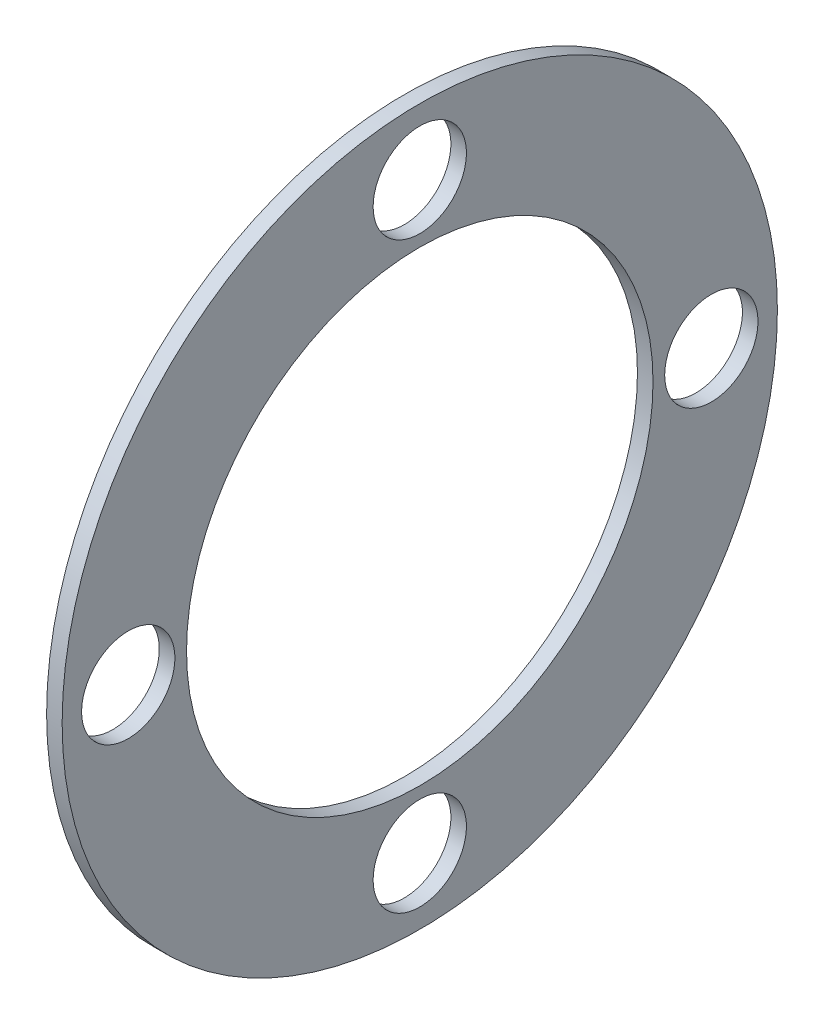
ISO-10303-21;
HEADER;
FILE_DESCRIPTION(('STEP AP214'),'2;1');
FILE_NAME('part.step','',(''),(''),'','','');
FILE_SCHEMA(('AUTOMOTIVE_DESIGN { 1 0 10303 214 1 1 1 1 }'));
ENDSEC;
DATA;
#1=APPLICATION_CONTEXT('core data for automotive mechanical design processes');
#2=APPLICATION_PROTOCOL_DEFINITION('international standard','automotive_design',2000,#1);
#3=PRODUCT_CONTEXT('',#1,'mechanical');
#4=PRODUCT('Part','Part','',(#3));
#5=PRODUCT_RELATED_PRODUCT_CATEGORY('part','',(#4));
#6=PRODUCT_DEFINITION_FORMATION('','',#4);
#7=PRODUCT_DEFINITION_CONTEXT('part definition',#1,'design');
#8=PRODUCT_DEFINITION('design','',#6,#7);
#9=PRODUCT_DEFINITION_SHAPE('','',#8);
#10=(LENGTH_UNIT() NAMED_UNIT(*) SI_UNIT(.MILLI.,.METRE.));
#11=(NAMED_UNIT(*) PLANE_ANGLE_UNIT() SI_UNIT($,.RADIAN.));
#12=(NAMED_UNIT(*) SI_UNIT($,.STERADIAN.) SOLID_ANGLE_UNIT());
#13=UNCERTAINTY_MEASURE_WITH_UNIT(LENGTH_MEASURE(1.E-05),#10,'distance_accuracy_value','');
#14=(GEOMETRIC_REPRESENTATION_CONTEXT(3) GLOBAL_UNCERTAINTY_ASSIGNED_CONTEXT((#13)) GLOBAL_UNIT_ASSIGNED_CONTEXT((#10,
#11,#12)) REPRESENTATION_CONTEXT('',''));
#15=CARTESIAN_POINT('',(0.,0.,0.));
#16=DIRECTION('',(0.,0.,1.));
#17=DIRECTION('',(1.,0.,0.));
#18=AXIS2_PLACEMENT_3D('',#15,#16,#17);
#19=CARTESIAN_POINT('',(2.,-12.9548266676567,0.));
#20=DIRECTION('',(-1.,0.,0.));
#21=DIRECTION('',(0.,0.,1.));
#22=AXIS2_PLACEMENT_3D('',#19,#20,#21);
#23=PLANE('',#22);
#24=CARTESIAN_POINT('',(2.,0.,0.));
#25=DIRECTION('',(-1.,0.,0.));
#26=DIRECTION('',(0.,0.,1.));
#27=AXIS2_PLACEMENT_3D('',#24,#25,#26);
#28=CIRCLE('',#27,30.);
#29=CARTESIAN_POINT('',(2.,0.,30.));
#30=VERTEX_POINT('',#29);
#31=EDGE_CURVE('E67',#30,#30,#28,.F.);
#32=ORIENTED_EDGE('',*,*,#31,.F.);
#33=EDGE_LOOP('',(#32));
#34=FACE_BOUND('',#33,.T.);
#35=CARTESIAN_POINT('',(2.,0.,-37.5));
#36=DIRECTION('',(-1.,0.,0.));
#37=DIRECTION('',(0.,0.,1.));
#38=AXIS2_PLACEMENT_3D('',#35,#36,#37);
#39=CIRCLE('',#38,5.99999999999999);
#40=CARTESIAN_POINT('',(2.,0.,-31.5));
#41=VERTEX_POINT('',#40);
#42=EDGE_CURVE('E61',#41,#41,#39,.F.);
#43=ORIENTED_EDGE('',*,*,#42,.F.);
#44=EDGE_LOOP('',(#43));
#45=FACE_BOUND('',#44,.T.);
#46=CARTESIAN_POINT('',(2.,-37.5,0.));
#47=DIRECTION('',(-1.,0.,0.));
#48=DIRECTION('',(0.,0.,1.));
#49=AXIS2_PLACEMENT_3D('',#46,#47,#48);
#50=CIRCLE('',#49,6.);
#51=CARTESIAN_POINT('',(2.,-37.5,6.));
#52=VERTEX_POINT('',#51);
#53=EDGE_CURVE('E55',#52,#52,#50,.F.);
#54=ORIENTED_EDGE('',*,*,#53,.F.);
#55=EDGE_LOOP('',(#54));
#56=FACE_BOUND('',#55,.T.);
#57=CARTESIAN_POINT('',(2.,0.,37.5));
#58=DIRECTION('',(-1.,0.,0.));
#59=DIRECTION('',(0.,0.,1.));
#60=AXIS2_PLACEMENT_3D('',#57,#58,#59);
#61=CIRCLE('',#60,5.99999999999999);
#62=CARTESIAN_POINT('',(2.,0.,43.5));
#63=VERTEX_POINT('',#62);
#64=EDGE_CURVE('E49',#63,#63,#61,.F.);
#65=ORIENTED_EDGE('',*,*,#64,.F.);
#66=EDGE_LOOP('',(#65));
#67=FACE_BOUND('',#66,.T.);
#68=CARTESIAN_POINT('',(2.,37.5,0.));
#69=DIRECTION('',(-1.,0.,0.));
#70=DIRECTION('',(0.,0.,1.));
#71=AXIS2_PLACEMENT_3D('',#68,#69,#70);
#72=CIRCLE('',#71,6.);
#73=CARTESIAN_POINT('',(2.,37.5,6.));
#74=VERTEX_POINT('',#73);
#75=EDGE_CURVE('E40',#74,#74,#72,.F.);
#76=ORIENTED_EDGE('',*,*,#75,.F.);
#77=EDGE_LOOP('',(#76));
#78=FACE_BOUND('',#77,.T.);
#79=CARTESIAN_POINT('',(2.,0.,0.));
#80=DIRECTION('',(1.,0.,0.));
#81=DIRECTION('',(0.,0.,-1.));
#82=AXIS2_PLACEMENT_3D('',#79,#80,#81);
#83=CIRCLE('',#82,46.);
#84=CARTESIAN_POINT('',(2.,0.,-46.));
#85=VERTEX_POINT('',#84);
#86=EDGE_CURVE('E10',#85,#85,#83,.T.);
#87=ORIENTED_EDGE('',*,*,#86,.T.);
#88=EDGE_LOOP('',(#87));
#89=FACE_BOUND('',#88,.T.);
#90=ADVANCED_FACE('F30',(#34,#45,#56,#67,#78,#89),#23,.F.);
#91=CARTESIAN_POINT('',(29.9069920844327,0.,0.));
#92=DIRECTION('',(1.,0.,0.));
#93=DIRECTION('',(0.,0.,-1.));
#94=AXIS2_PLACEMENT_3D('',#91,#92,#93);
#95=CYLINDRICAL_SURFACE('',#94,46.);
#96=ORIENTED_EDGE('',*,*,#86,.F.);
#97=EDGE_LOOP('',(#96));
#98=FACE_BOUND('',#97,.T.);
#99=CARTESIAN_POINT('',(0.,0.,0.));
#100=DIRECTION('',(1.,0.,0.));
#101=DIRECTION('',(0.,0.,-1.));
#102=AXIS2_PLACEMENT_3D('',#99,#100,#101);
#103=CIRCLE('',#102,46.);
#104=CARTESIAN_POINT('',(0.,0.,-46.));
#105=VERTEX_POINT('',#104);
#106=EDGE_CURVE('E36',#105,#105,#103,.T.);
#107=ORIENTED_EDGE('',*,*,#106,.T.);
#108=EDGE_LOOP('',(#107));
#109=FACE_BOUND('',#108,.T.);
#110=ADVANCED_FACE('F81',(#98,#109),#95,.T.);
#111=CARTESIAN_POINT('',(0.,-12.9548266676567,0.));
#112=DIRECTION('',(1.,0.,0.));
#113=DIRECTION('',(0.,0.,-1.));
#114=AXIS2_PLACEMENT_3D('',#111,#112,#113);
#115=PLANE('',#114);
#116=CARTESIAN_POINT('',(0.,0.,0.));
#117=DIRECTION('',(-1.,0.,0.));
#118=DIRECTION('',(0.,0.,1.));
#119=AXIS2_PLACEMENT_3D('',#116,#117,#118);
#120=CIRCLE('',#119,30.);
#121=CARTESIAN_POINT('',(0.,0.,30.));
#122=VERTEX_POINT('',#121);
#123=EDGE_CURVE('E70',#122,#122,#120,.T.);
#124=ORIENTED_EDGE('',*,*,#123,.F.);
#125=EDGE_LOOP('',(#124));
#126=FACE_BOUND('',#125,.T.);
#127=CARTESIAN_POINT('',(0.,0.,-37.5));
#128=DIRECTION('',(-1.,0.,0.));
#129=DIRECTION('',(0.,0.,1.));
#130=AXIS2_PLACEMENT_3D('',#127,#128,#129);
#131=CIRCLE('',#130,5.99999999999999);
#132=CARTESIAN_POINT('',(0.,0.,-31.5));
#133=VERTEX_POINT('',#132);
#134=EDGE_CURVE('E64',#133,#133,#131,.T.);
#135=ORIENTED_EDGE('',*,*,#134,.F.);
#136=EDGE_LOOP('',(#135));
#137=FACE_BOUND('',#136,.T.);
#138=CARTESIAN_POINT('',(0.,-37.5,0.));
#139=DIRECTION('',(-1.,0.,0.));
#140=DIRECTION('',(0.,0.,1.));
#141=AXIS2_PLACEMENT_3D('',#138,#139,#140);
#142=CIRCLE('',#141,6.);
#143=CARTESIAN_POINT('',(0.,-37.5,6.));
#144=VERTEX_POINT('',#143);
#145=EDGE_CURVE('E58',#144,#144,#142,.T.);
#146=ORIENTED_EDGE('',*,*,#145,.F.);
#147=EDGE_LOOP('',(#146));
#148=FACE_BOUND('',#147,.T.);
#149=CARTESIAN_POINT('',(0.,0.,37.5));
#150=DIRECTION('',(-1.,0.,0.));
#151=DIRECTION('',(0.,0.,1.));
#152=AXIS2_PLACEMENT_3D('',#149,#150,#151);
#153=CIRCLE('',#152,5.99999999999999);
#154=CARTESIAN_POINT('',(0.,0.,43.5));
#155=VERTEX_POINT('',#154);
#156=EDGE_CURVE('E52',#155,#155,#153,.T.);
#157=ORIENTED_EDGE('',*,*,#156,.F.);
#158=EDGE_LOOP('',(#157));
#159=FACE_BOUND('',#158,.T.);
#160=CARTESIAN_POINT('',(0.,37.5,0.));
#161=DIRECTION('',(-1.,0.,0.));
#162=DIRECTION('',(0.,0.,1.));
#163=AXIS2_PLACEMENT_3D('',#160,#161,#162);
#164=CIRCLE('',#163,6.);
#165=CARTESIAN_POINT('',(0.,37.5,6.));
#166=VERTEX_POINT('',#165);
#167=EDGE_CURVE('E44',#166,#166,#164,.T.);
#168=ORIENTED_EDGE('',*,*,#167,.F.);
#169=EDGE_LOOP('',(#168));
#170=FACE_BOUND('',#169,.T.);
#171=ORIENTED_EDGE('',*,*,#106,.F.);
#172=EDGE_LOOP('',(#171));
#173=FACE_BOUND('',#172,.T.);
#174=ADVANCED_FACE('F77',(#126,#137,#148,#159,#170,#173),#115,.F.);
#175=CARTESIAN_POINT('',(2.001,37.5,0.));
#176=DIRECTION('',(-1.,0.,0.));
#177=DIRECTION('',(0.,0.,1.));
#178=AXIS2_PLACEMENT_3D('',#175,#176,#177);
#179=CYLINDRICAL_SURFACE('',#178,6.);
#180=ORIENTED_EDGE('',*,*,#167,.T.);
#181=EDGE_LOOP('',(#180));
#182=FACE_BOUND('',#181,.T.);
#183=ORIENTED_EDGE('',*,*,#75,.T.);
#184=EDGE_LOOP('',(#183));
#185=FACE_BOUND('',#184,.T.);
#186=ADVANCED_FACE('F80',(#182,#185),#179,.F.);
#187=CARTESIAN_POINT('',(2.001,0.,37.5));
#188=DIRECTION('',(-1.,0.,0.));
#189=DIRECTION('',(0.,0.,1.));
#190=AXIS2_PLACEMENT_3D('',#187,#188,#189);
#191=CYLINDRICAL_SURFACE('',#190,5.99999999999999);
#192=ORIENTED_EDGE('',*,*,#156,.T.);
#193=EDGE_LOOP('',(#192));
#194=FACE_BOUND('',#193,.T.);
#195=ORIENTED_EDGE('',*,*,#64,.T.);
#196=EDGE_LOOP('',(#195));
#197=FACE_BOUND('',#196,.T.);
#198=ADVANCED_FACE('F94',(#194,#197),#191,.F.);
#199=CARTESIAN_POINT('',(2.001,-37.5,0.));
#200=DIRECTION('',(-1.,0.,0.));
#201=DIRECTION('',(0.,0.,1.));
#202=AXIS2_PLACEMENT_3D('',#199,#200,#201);
#203=CYLINDRICAL_SURFACE('',#202,6.);
#204=ORIENTED_EDGE('',*,*,#145,.T.);
#205=EDGE_LOOP('',(#204));
#206=FACE_BOUND('',#205,.T.);
#207=ORIENTED_EDGE('',*,*,#53,.T.);
#208=EDGE_LOOP('',(#207));
#209=FACE_BOUND('',#208,.T.);
#210=ADVANCED_FACE('F113',(#206,#209),#203,.F.);
#211=CARTESIAN_POINT('',(2.001,0.,-37.5));
#212=DIRECTION('',(-1.,0.,0.));
#213=DIRECTION('',(0.,0.,1.));
#214=AXIS2_PLACEMENT_3D('',#211,#212,#213);
#215=CYLINDRICAL_SURFACE('',#214,5.99999999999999);
#216=ORIENTED_EDGE('',*,*,#134,.T.);
#217=EDGE_LOOP('',(#216));
#218=FACE_BOUND('',#217,.T.);
#219=ORIENTED_EDGE('',*,*,#42,.T.);
#220=EDGE_LOOP('',(#219));
#221=FACE_BOUND('',#220,.T.);
#222=ADVANCED_FACE('F119',(#218,#221),#215,.F.);
#223=CARTESIAN_POINT('',(2.001,0.,0.));
#224=DIRECTION('',(-1.,0.,0.));
#225=DIRECTION('',(0.,0.,1.));
#226=AXIS2_PLACEMENT_3D('',#223,#224,#225);
#227=CYLINDRICAL_SURFACE('',#226,30.);
#228=ORIENTED_EDGE('',*,*,#123,.T.);
#229=EDGE_LOOP('',(#228));
#230=FACE_BOUND('',#229,.T.);
#231=ORIENTED_EDGE('',*,*,#31,.T.);
#232=EDGE_LOOP('',(#231));
#233=FACE_BOUND('',#232,.T.);
#234=ADVANCED_FACE('F74',(#230,#233),#227,.F.);
#235=CLOSED_SHELL('',(#90,#110,#174,#186,#198,#210,#222,#234));
#236=MANIFOLD_SOLID_BREP('B2',#235);
#237=ADVANCED_BREP_SHAPE_REPRESENTATION('',(#18,#236),#14);
#238=SHAPE_DEFINITION_REPRESENTATION(#9,#237);
ENDSEC;
END-ISO-10303-21;
